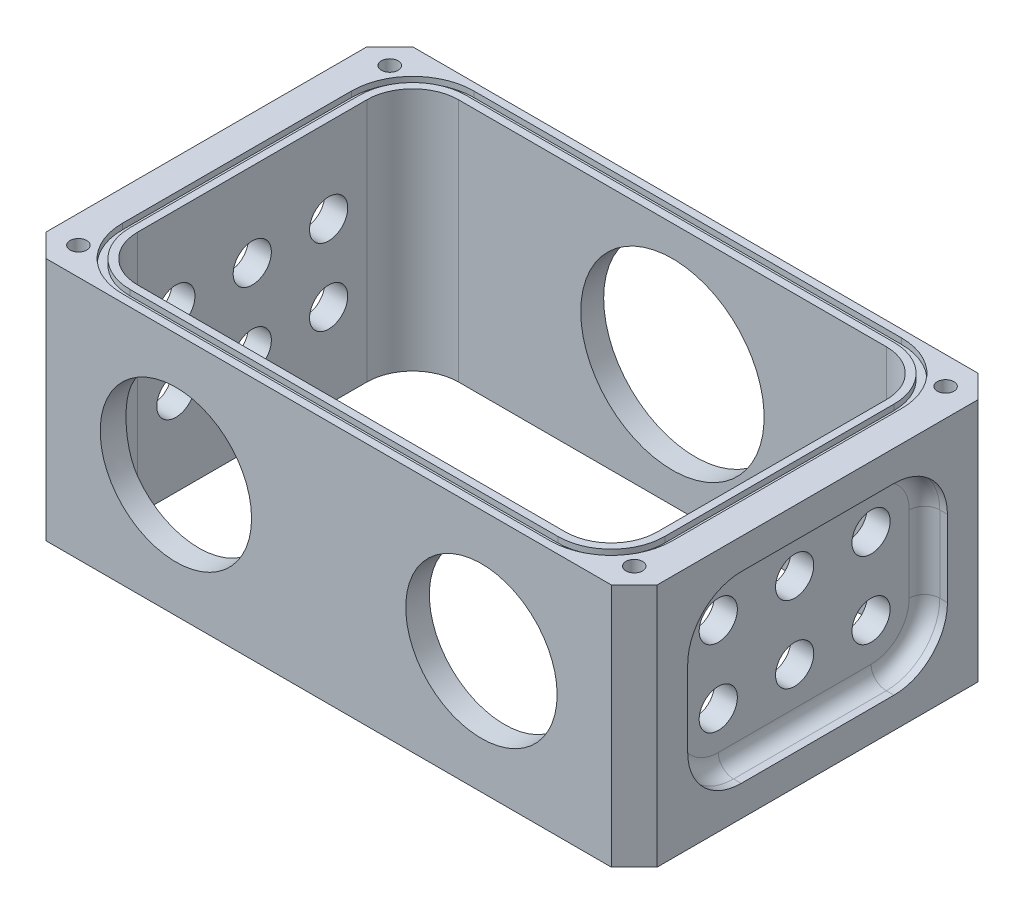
from build123d import *

# Parameters (mm, degrees)
SKETCH1_W                          = 127
SKETCH1_H                          = 76.2
BOSS_EXTRUDE1_DEPTH                = 25.4
CUT_EXTRUDE2_DEPTH                 = 38.1
CHAMFER3_SIZE                      = 4.7625
CUT_EXTRUDE6_DEPTH                 = 4.7625
SKETCH12_R                         = 0.79375
SKETCH13_R                         = 1.5875
CUT_EXTRUDE7_DEPTH                 = 90.802561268
MIRROR4_COPY_1_SKETCH_R            = 1.5875
MIRROR4_COPY_1_DEPTH               = 90.802561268
CUT_EXTRUDE8_DEPTH                 = 84.279469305
CUT_EXTRUDE8_DEPTH_BACK            = 84.279469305
F_1_NPT_TAPPED_HOLE1_AT_2_COUNT    = 2
F_1_NPT_TAPPED_HOLE1_AT_2_PITCH    = 63.5
SKETCH22_R                         = 19.05
CUT_EXTRUDE10_DEPTH                = 27.94
SKETCH18_R                         = 3.96875
CUT_EXTRUDE11_DEPTH                = 25.4
TAP_DRILL_FOR_8_32_TAP1_D          = 3.4544
TAP_DRILL_FOR_8_32_TAP1_DEPTH      = 2.772193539
TAP_DRILL_FOR_8_32_TAP1_TIP        = 1.037806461
SKETCH33_R                         = 1.5875
BOSS_EXTRUDE2_DEPTH                = 50.8
TAP_DRILL_FOR_8_32_TAP2_AT_2_COUNT = 2
TAP_DRILL_FOR_8_32_TAP2_AT_2_PITCH = 64.702307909
TAP_DRILL_FOR_8_32_TAP2_AT_3_COUNT = 2
TAP_DRILL_FOR_8_32_TAP2_AT_3_PITCH = 132.390225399
TAP_DRILL_FOR_8_32_TAP2_AT_4_COUNT = 2
TAP_DRILL_FOR_8_32_TAP2_AT_4_PITCH = 115.502307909
SKETCH35_W                         = 1.778
SKETCH35_H                         = 1.190625
BOSS_EXTRUDE3_DEPTH                = 2.54
FILLET1_R                          = 3.175
CUT_EXTRUDE13_DEPTH                = 1.190625


with BuildPart() as part:
    # Sketch1 → Boss-Extrude1 (new, symmetric)
    with BuildSketch(Plane(origin=(0, 0, 0), x_dir=(1, 0, 0), z_dir=(0, 1, 0))):
        Rectangle(SKETCH1_W, SKETCH1_H)
    extrude(amount=BOSS_EXTRUDE1_DEPTH, both=True)

    # Sketch3 → Cut-Extrude2 (cut)
    with BuildSketch(Plane(origin=(0, 25.4, 0), x_dir=(1, 0, 0), z_dir=(0, 1, 0))):
        with BuildLine():
            Line((53.975, -23.8125), (53.975, 23.8125))
            ThreePointArc((53.975, 23.8125), (51.185192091, 30.547692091), (44.45, 33.3375))
            Line((44.45, 33.3375), (-44.45, 33.3375))
            ThreePointArc((-44.45, 33.3375), (-51.185192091, 30.547692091), (-53.975, 23.8125))
            Line((-53.975, 23.8125), (-53.975, -23.8125))
            ThreePointArc((-53.975, -23.8125), (-51.185192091, -30.547692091), (-44.45, -33.3375))
            Line((-44.45, -33.3375), (44.45, -33.3375))
            ThreePointArc((44.45, -33.3375), (51.185192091, -30.547692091), (53.975, -23.8125))
        make_face()
    extrude(amount=-CUT_EXTRUDE2_DEPTH, mode=Mode.SUBTRACT)

    # Chamfer3
    chamfer3_edges = [part.edges().sort_by_distance(p)[0] for p in [
        (63.5, 0, 38.1),
        (-63.5, 0, 38.1),
        (-63.5, 0, -38.1),
        (63.5, 0, -38.1),
    ]]
    chamfer(chamfer3_edges, length=CHAMFER3_SIZE)

    # Sketch9 → Cut-Extrude6 (cut)
    with BuildSketch(Plane.ZY.offset(63.5)):
        with BuildLine():
            Line((-15.875, -19.05), (15.875, -19.05))
            ThreePointArc((15.875, -19.05), (23.732724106, -15.795224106), (26.9875, -7.9375))
            Line((26.9875, -7.9375), (26.9875, 7.9375))
            ThreePointArc((26.9875, 7.9375), (23.732724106, 15.795224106), (15.875, 19.05))
            Line((15.875, 19.05), (-15.875, 19.05))
            ThreePointArc((-15.875, 19.05), (-23.732724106, 15.795224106), (-26.9875, 7.9375))
            Line((-26.9875, 7.9375), (-26.9875, -7.9375))
            ThreePointArc((-26.9875, -7.9375), (-23.732724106, -15.795224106), (-15.875, -19.05))
        make_face()
    cut_extrude6 = extrude(amount=-CUT_EXTRUDE6_DEPTH, mode=Mode.SUBTRACT)

    # Mirror1: Cut-Extrude6 across plane
    add(cut_extrude6.mirror(Plane(origin=(0, 0, 0), x_dir=(0, 0, 1), z_dir=(1, 0, 0))), mode=Mode.SUBTRACT)

    # Cut-Sweep1: sweep along a path in Sketch11
    with BuildLine(Plane(origin=(0, 25.4, 0), x_dir=(1, 0, 0), z_dir=(0, 1, 0))) as cut_sweep1_path:
        Line((44.45, 35.71875), (-44.45, 35.71875))
        ThreePointArc((-44.45, 35.71875), (-52.868990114, 32.231490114), (-56.35625, 23.8125))
        Line((-56.35625, 23.8125), (-56.35625, -23.8125))
        ThreePointArc((-56.35625, -23.8125), (-52.868990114, -32.231490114), (-44.45, -35.71875))
        Line((-44.45, -35.71875), (44.45, -35.71875))
        ThreePointArc((44.45, -35.71875), (52.868990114, -32.231490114), (56.35625, -23.8125))
        Line((56.35625, -23.8125), (56.35625, 23.8125))
        ThreePointArc((56.35625, 23.8125), (52.868990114, 32.231490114), (44.45, 35.71875))
    # Sketch12 → Cut-Sweep1 (sweep, cut)
    with BuildSketch(Plane.XY.offset(23.8125)):
        with Locations((-56.35625, 25.654)):
            Circle(SKETCH12_R)
    cut_sweep1 = sweep(path=cut_sweep1_path.line, mode=Mode.SUBTRACT)

    # Mirror2: Cut-Sweep1 across plane
    add(cut_sweep1.mirror(Plane.ZX), mode=Mode.SUBTRACT)

    # Sketch13 → Cut-Extrude7 (cut, symmetric)
    with BuildSketch(Plane(origin=(0, 25.4, 0), x_dir=(1, 0, 0), z_dir=(0, 1, 0))):
        with Locations(Location((-57.751153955, 32.351153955, 0), (0, 0, 270))):
            Circle(SKETCH13_R)
    cut_extrude7 = extrude(amount=CUT_EXTRUDE7_DEPTH, both=True, mode=Mode.SUBTRACT)

    # Mirror3: Cut-Extrude7 across plane
    add(cut_extrude7.mirror(Plane(origin=(0, 0, 0), x_dir=(0, 0, 1), z_dir=(1, 0, 0))), mode=Mode.SUBTRACT)

    # Mirror4: Cut-Extrude7 across plane
    add(cut_extrude7.mirror(Plane.XY), mode=Mode.SUBTRACT)

    # Mirror4 copy 1 sketch → Mirror4 copy 1 (cut, symmetric)
    with BuildSketch(Plane(origin=(0, 25.4, 0), x_dir=(-1, 0, 0), z_dir=(0, 1, 0))):
        with Locations(Location((-57.751153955, 32.351153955, 0), (0, 0, 270))):
            Circle(MIRROR4_COPY_1_SKETCH_R)
    extrude(amount=MIRROR4_COPY_1_DEPTH, both=True, mode=Mode.SUBTRACT)

    # Sketch15 → Cut-Extrude8 (cut, two sides: drawn at the far end of the back side and taken through both)
    with BuildSketch(Plane(origin=(0, -12.7, 0), x_dir=(1, 0, 0), z_dir=(0, 1, 0)).offset(-CUT_EXTRUDE8_DEPTH_BACK)):
        with BuildLine():
            Line((44.45, 33.3375), (-44.45, 33.3375))
            ThreePointArc((-44.45, 33.3375), (-51.185192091, 30.547692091), (-53.975, 23.8125))
            Line((-53.975, 23.8125), (-53.975, -23.8125))
            ThreePointArc((-53.975, -23.8125), (-51.185192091, -30.547692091), (-44.45, -33.3375))
            Line((-44.45, -33.3375), (44.45, -33.3375))
            ThreePointArc((44.45, -33.3375), (51.185192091, -30.547692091), (53.975, -23.8125))
            Line((53.975, -23.8125), (53.975, 23.8125))
            ThreePointArc((53.975, 23.8125), (51.185192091, 30.547692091), (44.45, 33.3375))
        make_face()
    extrude(amount=CUT_EXTRUDE8_DEPTH + CUT_EXTRUDE8_DEPTH_BACK, mode=Mode.SUBTRACT)

    # Sketch17 → 1 NPT Tapped Hole1 (revolve, cut)
    with BuildSketch(Plane(origin=(-31.75, 0, 38.1), x_dir=(0, -1, 0), z_dir=(1, 0, 0))):
        Polygon((0, 0), (0, 36.646890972), (14.4907, 27.94), (14.4907, 5.206443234), (15.574027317, 5.206443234), (15.7299152, 0), align=None)
    f_1_npt_tapped_hole1 = revolve(axis=Axis((-31.75, 0, 44.45), (0, 0, -1)), mode=Mode.SUBTRACT)

    # 1 NPT Tapped Hole1 at 2: 1 NPT Tapped Hole1 ×2
    with Locations(*[(i * F_1_NPT_TAPPED_HOLE1_AT_2_PITCH, 0, 0) for i in range(1, F_1_NPT_TAPPED_HOLE1_AT_2_COUNT)]):
        add(f_1_npt_tapped_hole1, mode=Mode.SUBTRACT)

    # Sketch22 → Cut-Extrude10 (cut)
    with BuildSketch(Plane(origin=(0, 0, -38.1), x_dir=(-1, 0, 0), z_dir=(0, 0, -1))):
        Circle(SKETCH22_R)
    extrude(amount=-CUT_EXTRUDE10_DEPTH, mode=Mode.SUBTRACT)

    # Sketch18 → Cut-Extrude11 (cut)
    with BuildSketch(Plane.ZY.offset(58.7375)):
        with Locations((-15.875, 7.9375)):
            Circle(SKETCH18_R)
        with Locations((0, 7.9375)):
            Circle(SKETCH18_R)
        with Locations((15.875, 7.9375)):
            Circle(SKETCH18_R)
        with Locations((15.875, -7.9375)):
            Circle(SKETCH18_R)
        with Locations((0, -7.9375)):
            Circle(SKETCH18_R)
        with Locations((-15.875, -7.9375)):
            Circle(SKETCH18_R)
    cut_extrude11 = extrude(amount=-CUT_EXTRUDE11_DEPTH, mode=Mode.SUBTRACT)

    # Mirror5: Cut-Extrude11 across plane
    add(cut_extrude11.mirror(Plane(origin=(0, 0, 0), x_dir=(0, 0, 1), z_dir=(1, 0, 0))), mode=Mode.SUBTRACT)

    # Tap Drill for _8-32 Tap1
    with Locations(Plane(origin=(25.4, 20.6375, -38.1), x_dir=(-1, 0, 0), z_dir=(0, 0, -1))):
        with Locations((0, 0), (50.8, 0), (50.8, -41.275), (0, -41.275)):
            Hole(TAP_DRILL_FOR_8_32_TAP1_D / 2, depth=TAP_DRILL_FOR_8_32_TAP1_DEPTH)
            with Locations((0, 0, -(TAP_DRILL_FOR_8_32_TAP1_DEPTH + TAP_DRILL_FOR_8_32_TAP1_TIP / 2))):  # 118° drill point
                Cone(0, TAP_DRILL_FOR_8_32_TAP1_D / 2, TAP_DRILL_FOR_8_32_TAP1_TIP, mode=Mode.SUBTRACT)

    # Sketch33 → Boss-Extrude2 (add)
    with BuildSketch(Plane(origin=(0, 25.4, 0), x_dir=(1, 0, 0), z_dir=(0, 1, 0))):
        with Locations((57.751153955, 32.351153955)):
            Circle(SKETCH33_R)
        with Locations((57.751153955, -32.351153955)):
            Circle(SKETCH33_R)
        with Locations((-57.751153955, -32.351153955)):
            Circle(SKETCH33_R)
        with Locations((-57.751153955, 32.351153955)):
            Circle(SKETCH33_R)
    extrude(amount=-BOSS_EXTRUDE2_DEPTH)

    # Sketch34 → Tap Drill for _8-32 Tap2 (revolve, cut)
    with BuildSketch(Plane(origin=(57.751153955, 25.4, 32.351153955), x_dir=(0, 0, 1), z_dir=(1, 0, 0))):
        Polygon((0, 0), (0, 12.7), (1.7272, 11.662193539), (1.7272, 0), align=None)
    tap_drill_for_8_32_tap2 = revolve(axis=Axis((57.751153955, 31.75, 32.351153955), (0, -1, 0)), mode=Mode.SUBTRACT)

    # Tap Drill for _8-32 Tap2 at 2: Tap Drill for _8-32 Tap2 ×2
    with Locations(*[(0, 0, -i * TAP_DRILL_FOR_8_32_TAP2_AT_2_PITCH) for i in range(1, TAP_DRILL_FOR_8_32_TAP2_AT_2_COUNT)]):
        add(tap_drill_for_8_32_tap2, mode=Mode.SUBTRACT)

    # Tap Drill for _8-32 Tap2 at 3: Tap Drill for _8-32 Tap2 ×2
    with Locations(*[Vector(-0.8724383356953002, 0, -0.488724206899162) * (i * TAP_DRILL_FOR_8_32_TAP2_AT_3_PITCH) for i in range(1, TAP_DRILL_FOR_8_32_TAP2_AT_3_COUNT)]):
        add(tap_drill_for_8_32_tap2, mode=Mode.SUBTRACT)

    # Tap Drill for _8-32 Tap2 at 4: Tap Drill for _8-32 Tap2 ×2
    with Locations(*[(-i * TAP_DRILL_FOR_8_32_TAP2_AT_4_PITCH, 0, 0) for i in range(1, TAP_DRILL_FOR_8_32_TAP2_AT_4_COUNT)]):
        add(tap_drill_for_8_32_tap2, mode=Mode.SUBTRACT)

    # Mirror6: Tap Drill for _8-32 Tap2 across plane
    add(tap_drill_for_8_32_tap2.mirror(Plane.ZX), mode=Mode.SUBTRACT)

    # Mirror6 copy 1 sketch → Mirror6 copy 1 (revolve, cut)
    with BuildSketch(Plane(origin=(57.751153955, -25.4, -32.351153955), x_dir=(0, 0, 1), z_dir=(1, 0, 0))):
        Polygon((0, 0), (0, -12.7), (1.7272, -11.662193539), (1.7272, 0), align=None)
    revolve(axis=Axis((57.751153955, -31.75, -32.351153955), (0, -1, 0)), mode=Mode.SUBTRACT)

    # Mirror6 copy 2 sketch → Mirror6 copy 2 (revolve, cut)
    with BuildSketch(Plane(origin=(-57.751153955, -25.4, -32.351153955), x_dir=(0, 0, 1), z_dir=(1, 0, 0))):
        Polygon((0, 0), (0, -12.7), (1.7272, -11.662193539), (1.7272, 0), align=None)
    revolve(axis=Axis((-57.751153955, -31.75, -32.351153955), (0, -1, 0)), mode=Mode.SUBTRACT)

    # Mirror6 copy 3 sketch → Mirror6 copy 3 (revolve, cut)
    with BuildSketch(Plane(origin=(-57.751153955, -25.4, 32.351153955), x_dir=(0, 0, 1), z_dir=(1, 0, 0))):
        Polygon((0, 0), (0, -12.7), (1.7272, -11.662193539), (1.7272, 0), align=None)
    revolve(axis=Axis((-57.751153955, -31.75, 32.351153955), (0, -1, 0)), mode=Mode.SUBTRACT)

    # Sketch35 → Cut-Revolve1 (revolve, cut)
    with BuildSketch(Plane(origin=(0, 0, 0), x_dir=(1, 0, 0), z_dir=(0, 1, 0)), mode=Mode.PRIVATE) as cut_revolve1_sk:
        with Locations((-22.9743, 37.5046875)):
            Rectangle(SKETCH35_W, SKETCH35_H)
    revolve(cut_revolve1_sk.sketch.rotate(Axis((0, 0, -38.1), (0, 0, -1)), 180), axis=Axis((0, 0, -38.1), (0, 0, -1)), mode=Mode.SUBTRACT)

    # Sketch36 → Boss-Extrude3 (add)
    with BuildSketch(Plane(origin=(0, 25.4, 0), x_dir=(1, 0, 0), z_dir=(0, 1, 0))):
        with BuildLine():
            Line((-57.108262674, 23.8125), (-57.108262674, -23.8125))
            ThreePointArc((-57.108262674, -23.8125), (-53.400743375, -32.763243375), (-44.45, -36.470762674))
            Line((-44.45, -36.470762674), (44.45, -36.470762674))
            ThreePointArc((44.45, -36.470762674), (53.400743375, -32.763243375), (57.108262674, -23.8125))
            Line((57.108262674, -23.8125), (57.108262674, 23.8125))
            ThreePointArc((57.108262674, 23.8125), (53.400743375, 32.763243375), (44.45, 36.470762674))
            Line((44.45, 36.470762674), (-44.45, 36.470762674))
            ThreePointArc((-44.45, 36.470762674), (-53.400743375, 32.763243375), (-57.108262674, 23.8125))
        make_face()
        with BuildLine():
            Line((-55.604237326, -23.8125), (-55.604237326, 23.8125))
            ThreePointArc((-55.604237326, 23.8125), (-52.337236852, 31.699736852), (-44.45, 34.966737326))
            Line((-44.45, 34.966737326), (44.45, 34.966737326))
            ThreePointArc((44.45, 34.966737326), (52.337236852, 31.699736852), (55.604237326, 23.8125))
            Line((55.604237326, 23.8125), (55.604237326, -23.8125))
            ThreePointArc((55.604237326, -23.8125), (52.337236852, -31.699736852), (44.45, -34.966737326))
            Line((44.45, -34.966737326), (-44.45, -34.966737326))
            ThreePointArc((-44.45, -34.966737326), (-52.337236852, -31.699736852), (-55.604237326, -23.8125))
        make_face(mode=Mode.SUBTRACT)
    boss_extrude3 = extrude(amount=-BOSS_EXTRUDE3_DEPTH)

    # Mirror7: Boss-Extrude3 across plane
    add(boss_extrude3.mirror(Plane.ZX))

    # Fillet1
    fillet1_edges = [part.edges().sort_by_distance(p)[0] for p in [
        (-58.7375, 15.795224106, 23.732724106),
        (-58.7375, 0, 26.9875),
        (-58.7375, -15.795224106, 23.732724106),
        (-58.7375, -19.05, 0),
        (-58.7375, -15.795224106, -23.732724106),
        (-58.7375, 0, -26.9875),
        (-58.7375, 15.795224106, -23.732724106),
        (-58.7375, 19.05, 0),
        (58.7375, 15.795224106, 23.732724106),
        (58.7375, 0, 26.9875),
        (58.7375, -15.795224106, 23.732724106),
        (58.7375, -19.05, 0),
        (58.7375, -15.795224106, -23.732724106),
        (58.7375, 0, -26.9875),
        (58.7375, 15.795224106, -23.732724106),
        (58.7375, 19.05, 0),
    ]]
    fillet(fillet1_edges, radius=FILLET1_R)

    # Sketch39 → Cut-Extrude13 (cut)
    with BuildSketch(Plane(origin=(0, 25.4, 0), x_dir=(1, 0, 0), z_dir=(0, 1, 0))):
        with BuildLine():
            Line((-57.15, 23.8125), (-57.15, -23.8125))
            ThreePointArc((-57.15, -23.8125), (-53.430256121, -32.792756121), (-44.45, -36.5125))
            Line((-44.45, -36.5125), (44.45, -36.5125))
            ThreePointArc((44.45, -36.5125), (53.430256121, -32.792756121), (57.15, -23.8125))
            Line((57.15, -23.8125), (57.15, 23.8125))
            ThreePointArc((57.15, 23.8125), (53.430256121, 32.792756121), (44.45, 36.5125))
            Line((44.45, 36.5125), (-44.45, 36.5125))
            ThreePointArc((-44.45, 36.5125), (-53.430256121, 32.792756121), (-57.15, 23.8125))
        make_face()
        with BuildLine():
            Line((-55.5625, 23.8125), (-55.5625, -23.8125))
            ThreePointArc((-55.5625, -23.8125), (-52.307724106, -31.670224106), (-44.45, -34.925))
            Line((-44.45, -34.925), (44.45, -34.925))
            ThreePointArc((44.45, -34.925), (52.307724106, -31.670224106), (55.5625, -23.8125))
            Line((55.5625, -23.8125), (55.5625, 23.8125))
            ThreePointArc((55.5625, 23.8125), (52.307724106, 31.670224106), (44.45, 34.925))
            Line((44.45, 34.925), (-44.45, 34.925))
            ThreePointArc((-44.45, 34.925), (-52.307724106, 31.670224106), (-55.5625, 23.8125))
        make_face(mode=Mode.SUBTRACT)
    cut_extrude13 = extrude(amount=-CUT_EXTRUDE13_DEPTH, mode=Mode.SUBTRACT)

    # Mirror10: Cut-Extrude13 across plane
    add(cut_extrude13.mirror(Plane.ZX), mode=Mode.SUBTRACT)


solid = part.part
